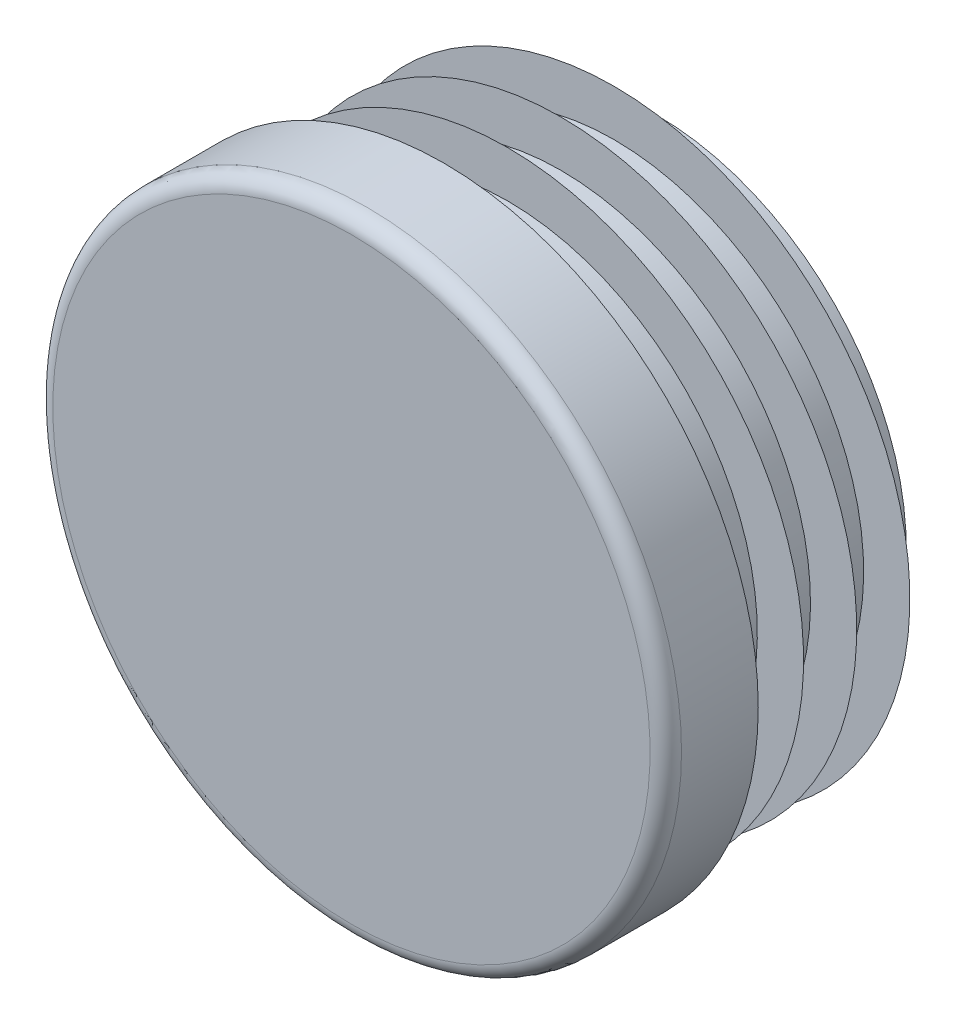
ISO-10303-21;
HEADER;
FILE_DESCRIPTION(('STEP AP214'),'2;1');
FILE_NAME('part.step','',(''),(''),'','','');
FILE_SCHEMA(('AUTOMOTIVE_DESIGN { 1 0 10303 214 1 1 1 1 }'));
ENDSEC;
DATA;
#1=APPLICATION_CONTEXT('core data for automotive mechanical design processes');
#2=APPLICATION_PROTOCOL_DEFINITION('international standard','automotive_design',2000,#1);
#3=PRODUCT_CONTEXT('',#1,'mechanical');
#4=PRODUCT('Part','Part','',(#3));
#5=PRODUCT_RELATED_PRODUCT_CATEGORY('part','',(#4));
#6=PRODUCT_DEFINITION_FORMATION('','',#4);
#7=PRODUCT_DEFINITION_CONTEXT('part definition',#1,'design');
#8=PRODUCT_DEFINITION('design','',#6,#7);
#9=PRODUCT_DEFINITION_SHAPE('','',#8);
#10=(LENGTH_UNIT() NAMED_UNIT(*) SI_UNIT(.MILLI.,.METRE.));
#11=(NAMED_UNIT(*) PLANE_ANGLE_UNIT() SI_UNIT($,.RADIAN.));
#12=(NAMED_UNIT(*) SI_UNIT($,.STERADIAN.) SOLID_ANGLE_UNIT());
#13=UNCERTAINTY_MEASURE_WITH_UNIT(LENGTH_MEASURE(1.E-05),#10,'distance_accuracy_value','');
#14=(GEOMETRIC_REPRESENTATION_CONTEXT(3) GLOBAL_UNCERTAINTY_ASSIGNED_CONTEXT((#13)) GLOBAL_UNIT_ASSIGNED_CONTEXT((#10,
#11,#12)) REPRESENTATION_CONTEXT('',''));
#15=CARTESIAN_POINT('',(0.,0.,0.));
#16=DIRECTION('',(0.,0.,1.));
#17=DIRECTION('',(1.,0.,0.));
#18=AXIS2_PLACEMENT_3D('',#15,#16,#17);
#19=CARTESIAN_POINT('',(0.,0.,5.));
#20=DIRECTION('',(0.,0.,-1.));
#21=DIRECTION('',(0.,1.,0.));
#22=AXIS2_PLACEMENT_3D('',#19,#20,#21);
#23=PLANE('',#22);
#24=CARTESIAN_POINT('',(0.,0.,5.));
#25=DIRECTION('',(0.,0.,-1.));
#26=DIRECTION('',(0.,1.,0.));
#27=AXIS2_PLACEMENT_3D('',#24,#25,#26);
#28=CIRCLE('',#27,16.15);
#29=CARTESIAN_POINT('',(0.,16.15,5.));
#30=VERTEX_POINT('',#29);
#31=EDGE_CURVE('E8',#30,#30,#28,.T.);
#32=ORIENTED_EDGE('',*,*,#31,.F.);
#33=EDGE_LOOP('',(#32));
#34=FACE_BOUND('',#33,.T.);
#35=ADVANCED_FACE('F12',(#34),#23,.F.);
#36=CARTESIAN_POINT('',(0.,0.,4.15));
#37=DIRECTION('',(0.,0.,-1.));
#38=DIRECTION('',(0.,1.,0.));
#39=AXIS2_PLACEMENT_3D('',#36,#37,#38);
#40=TOROIDAL_SURFACE('',#39,16.15,0.85);
#41=ORIENTED_EDGE('',*,*,#31,.T.);
#42=EDGE_LOOP('',(#41));
#43=FACE_BOUND('',#42,.T.);
#44=CARTESIAN_POINT('',(0.,0.,4.15));
#45=DIRECTION('',(0.,0.,-1.));
#46=DIRECTION('',(0.,1.,0.));
#47=AXIS2_PLACEMENT_3D('',#44,#45,#46);
#48=CIRCLE('',#47,17.);
#49=CARTESIAN_POINT('',(0.,17.,4.15));
#50=VERTEX_POINT('',#49);
#51=EDGE_CURVE('E18',#50,#50,#48,.T.);
#52=ORIENTED_EDGE('',*,*,#51,.F.);
#53=EDGE_LOOP('',(#52));
#54=FACE_BOUND('',#53,.T.);
#55=ADVANCED_FACE('F159',(#43,#54),#40,.T.);
#56=CARTESIAN_POINT('',(0.,0.,-11.5));
#57=DIRECTION('',(0.,0.,-1.));
#58=DIRECTION('',(0.,1.,0.));
#59=AXIS2_PLACEMENT_3D('',#56,#57,#58);
#60=CYLINDRICAL_SURFACE('',#59,17.);
#61=CARTESIAN_POINT('',(0.,0.,0.));
#62=DIRECTION('',(0.,0.,-1.));
#63=DIRECTION('',(0.,1.,0.));
#64=AXIS2_PLACEMENT_3D('',#61,#62,#63);
#65=CIRCLE('',#64,17.);
#66=CARTESIAN_POINT('',(0.,17.,0.));
#67=VERTEX_POINT('',#66);
#68=EDGE_CURVE('E22',#67,#67,#65,.T.);
#69=ORIENTED_EDGE('',*,*,#68,.F.);
#70=EDGE_LOOP('',(#69));
#71=FACE_BOUND('',#70,.T.);
#72=ORIENTED_EDGE('',*,*,#51,.T.);
#73=EDGE_LOOP('',(#72));
#74=FACE_BOUND('',#73,.T.);
#75=ADVANCED_FACE('F154',(#71,#74),#60,.T.);
#76=CARTESIAN_POINT('',(17.,0.,0.));
#77=DIRECTION('',(0.,0.,1.));
#78=DIRECTION('',(0.,-1.,0.));
#79=AXIS2_PLACEMENT_3D('',#76,#77,#78);
#80=PLANE('',#79);
#81=CARTESIAN_POINT('',(0.,0.,0.));
#82=DIRECTION('',(0.,0.,-1.));
#83=DIRECTION('',(0.,1.,0.));
#84=AXIS2_PLACEMENT_3D('',#81,#82,#83);
#85=CIRCLE('',#84,13.5);
#86=CARTESIAN_POINT('',(0.,13.5,0.));
#87=VERTEX_POINT('',#86);
#88=EDGE_CURVE('E26',#87,#87,#85,.T.);
#89=ORIENTED_EDGE('',*,*,#88,.F.);
#90=EDGE_LOOP('',(#89));
#91=FACE_BOUND('',#90,.T.);
#92=ORIENTED_EDGE('',*,*,#68,.T.);
#93=EDGE_LOOP('',(#92));
#94=FACE_BOUND('',#93,.T.);
#95=ADVANCED_FACE('F148',(#91,#94),#80,.F.);
#96=CARTESIAN_POINT('',(0.,0.,-11.5));
#97=DIRECTION('',(0.,0.,-1.));
#98=DIRECTION('',(0.,1.,0.));
#99=AXIS2_PLACEMENT_3D('',#96,#97,#98);
#100=CYLINDRICAL_SURFACE('',#99,13.5);
#101=CARTESIAN_POINT('',(0.,0.,-0.575));
#102=DIRECTION('',(0.,0.,-1.));
#103=DIRECTION('',(0.,1.,0.));
#104=AXIS2_PLACEMENT_3D('',#101,#102,#103);
#105=CIRCLE('',#104,13.5);
#106=CARTESIAN_POINT('',(0.,13.5,-0.575));
#107=VERTEX_POINT('',#106);
#108=EDGE_CURVE('E31',#107,#107,#105,.T.);
#109=ORIENTED_EDGE('',*,*,#108,.F.);
#110=EDGE_LOOP('',(#109));
#111=FACE_BOUND('',#110,.T.);
#112=ORIENTED_EDGE('',*,*,#88,.T.);
#113=EDGE_LOOP('',(#112));
#114=FACE_BOUND('',#113,.T.);
#115=ADVANCED_FACE('F142',(#111,#114),#100,.T.);
#116=CARTESIAN_POINT('',(13.5,0.,-0.575));
#117=DIRECTION('',(0.,0.,-1.));
#118=DIRECTION('',(0.,1.,0.));
#119=AXIS2_PLACEMENT_3D('',#116,#117,#118);
#120=PLANE('',#119);
#121=CARTESIAN_POINT('',(0.,0.,-0.575));
#122=DIRECTION('',(0.,0.,-1.));
#123=DIRECTION('',(0.,1.,0.));
#124=AXIS2_PLACEMENT_3D('',#121,#122,#123);
#125=CIRCLE('',#124,16.);
#126=CARTESIAN_POINT('',(0.,16.,-0.575));
#127=VERTEX_POINT('',#126);
#128=EDGE_CURVE('E34',#127,#127,#125,.T.);
#129=ORIENTED_EDGE('',*,*,#128,.F.);
#130=EDGE_LOOP('',(#129));
#131=FACE_BOUND('',#130,.T.);
#132=ORIENTED_EDGE('',*,*,#108,.T.);
#133=EDGE_LOOP('',(#132));
#134=FACE_BOUND('',#133,.T.);
#135=ADVANCED_FACE('F136',(#131,#134),#120,.F.);
#136=CARTESIAN_POINT('',(0.,0.,-0.575));
#137=DIRECTION('',(0.,0.,1.));
#138=DIRECTION('',(0.,-1.,0.));
#139=AXIS2_PLACEMENT_3D('',#136,#137,#138);
#140=CONICAL_SURFACE('',#139,16.,0.959931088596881);
#141=CARTESIAN_POINT('',(0.,0.,-2.32551884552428));
#142=DIRECTION('',(0.,0.,-1.));
#143=DIRECTION('',(0.,1.,0.));
#144=AXIS2_PLACEMENT_3D('',#141,#142,#143);
#145=CIRCLE('',#144,13.5);
#146=CARTESIAN_POINT('',(0.,13.5,-2.32551884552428));
#147=VERTEX_POINT('',#146);
#148=EDGE_CURVE('E37',#147,#147,#145,.T.);
#149=ORIENTED_EDGE('',*,*,#148,.F.);
#150=EDGE_LOOP('',(#149));
#151=FACE_BOUND('',#150,.T.);
#152=ORIENTED_EDGE('',*,*,#128,.T.);
#153=EDGE_LOOP('',(#152));
#154=FACE_BOUND('',#153,.T.);
#155=ADVANCED_FACE('F130',(#151,#154),#140,.T.);
#156=CARTESIAN_POINT('',(0.,0.,-11.5));
#157=DIRECTION('',(0.,0.,-1.));
#158=DIRECTION('',(0.,1.,0.));
#159=AXIS2_PLACEMENT_3D('',#156,#157,#158);
#160=CYLINDRICAL_SURFACE('',#159,13.5);
#161=CARTESIAN_POINT('',(0.,0.,-3.45));
#162=DIRECTION('',(0.,0.,-1.));
#163=DIRECTION('',(0.,1.,0.));
#164=AXIS2_PLACEMENT_3D('',#161,#162,#163);
#165=CIRCLE('',#164,13.5);
#166=CARTESIAN_POINT('',(0.,13.5,-3.45));
#167=VERTEX_POINT('',#166);
#168=EDGE_CURVE('E40',#167,#167,#165,.T.);
#169=ORIENTED_EDGE('',*,*,#168,.F.);
#170=EDGE_LOOP('',(#169));
#171=FACE_BOUND('',#170,.T.);
#172=ORIENTED_EDGE('',*,*,#148,.T.);
#173=EDGE_LOOP('',(#172));
#174=FACE_BOUND('',#173,.T.);
#175=ADVANCED_FACE('F124',(#171,#174),#160,.T.);
#176=CARTESIAN_POINT('',(13.5,0.,-3.45));
#177=DIRECTION('',(0.,0.,-1.));
#178=DIRECTION('',(0.,1.,0.));
#179=AXIS2_PLACEMENT_3D('',#176,#177,#178);
#180=PLANE('',#179);
#181=CARTESIAN_POINT('',(0.,0.,-3.45));
#182=DIRECTION('',(0.,0.,-1.));
#183=DIRECTION('',(0.,1.,0.));
#184=AXIS2_PLACEMENT_3D('',#181,#182,#183);
#185=CIRCLE('',#184,16.);
#186=CARTESIAN_POINT('',(0.,16.,-3.45));
#187=VERTEX_POINT('',#186);
#188=EDGE_CURVE('E43',#187,#187,#185,.T.);
#189=ORIENTED_EDGE('',*,*,#188,.F.);
#190=EDGE_LOOP('',(#189));
#191=FACE_BOUND('',#190,.T.);
#192=ORIENTED_EDGE('',*,*,#168,.T.);
#193=EDGE_LOOP('',(#192));
#194=FACE_BOUND('',#193,.T.);
#195=ADVANCED_FACE('F118',(#191,#194),#180,.F.);
#196=CARTESIAN_POINT('',(0.,0.,-3.45));
#197=DIRECTION('',(0.,0.,1.));
#198=DIRECTION('',(0.,-1.,0.));
#199=AXIS2_PLACEMENT_3D('',#196,#197,#198);
#200=CONICAL_SURFACE('',#199,16.,0.959931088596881);
#201=CARTESIAN_POINT('',(0.,0.,-5.20051884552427));
#202=DIRECTION('',(0.,0.,-1.));
#203=DIRECTION('',(0.,1.,0.));
#204=AXIS2_PLACEMENT_3D('',#201,#202,#203);
#205=CIRCLE('',#204,13.5);
#206=CARTESIAN_POINT('',(0.,13.5,-5.20051884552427));
#207=VERTEX_POINT('',#206);
#208=EDGE_CURVE('E46',#207,#207,#205,.T.);
#209=ORIENTED_EDGE('',*,*,#208,.F.);
#210=EDGE_LOOP('',(#209));
#211=FACE_BOUND('',#210,.T.);
#212=ORIENTED_EDGE('',*,*,#188,.T.);
#213=EDGE_LOOP('',(#212));
#214=FACE_BOUND('',#213,.T.);
#215=ADVANCED_FACE('F112',(#211,#214),#200,.T.);
#216=CARTESIAN_POINT('',(0.,0.,-11.5));
#217=DIRECTION('',(0.,0.,-1.));
#218=DIRECTION('',(0.,1.,0.));
#219=AXIS2_PLACEMENT_3D('',#216,#217,#218);
#220=CYLINDRICAL_SURFACE('',#219,13.5);
#221=CARTESIAN_POINT('',(0.,0.,-6.325));
#222=DIRECTION('',(0.,0.,-1.));
#223=DIRECTION('',(0.,1.,0.));
#224=AXIS2_PLACEMENT_3D('',#221,#222,#223);
#225=CIRCLE('',#224,13.5);
#226=CARTESIAN_POINT('',(0.,13.5,-6.325));
#227=VERTEX_POINT('',#226);
#228=EDGE_CURVE('E49',#227,#227,#225,.T.);
#229=ORIENTED_EDGE('',*,*,#228,.F.);
#230=EDGE_LOOP('',(#229));
#231=FACE_BOUND('',#230,.T.);
#232=ORIENTED_EDGE('',*,*,#208,.T.);
#233=EDGE_LOOP('',(#232));
#234=FACE_BOUND('',#233,.T.);
#235=ADVANCED_FACE('F106',(#231,#234),#220,.T.);
#236=CARTESIAN_POINT('',(13.5,0.,-6.325));
#237=DIRECTION('',(0.,0.,-1.));
#238=DIRECTION('',(0.,1.,0.));
#239=AXIS2_PLACEMENT_3D('',#236,#237,#238);
#240=PLANE('',#239);
#241=CARTESIAN_POINT('',(0.,0.,-6.325));
#242=DIRECTION('',(0.,0.,-1.));
#243=DIRECTION('',(0.,1.,0.));
#244=AXIS2_PLACEMENT_3D('',#241,#242,#243);
#245=CIRCLE('',#244,16.);
#246=CARTESIAN_POINT('',(0.,16.,-6.325));
#247=VERTEX_POINT('',#246);
#248=EDGE_CURVE('E52',#247,#247,#245,.T.);
#249=ORIENTED_EDGE('',*,*,#248,.F.);
#250=EDGE_LOOP('',(#249));
#251=FACE_BOUND('',#250,.T.);
#252=ORIENTED_EDGE('',*,*,#228,.T.);
#253=EDGE_LOOP('',(#252));
#254=FACE_BOUND('',#253,.T.);
#255=ADVANCED_FACE('F100',(#251,#254),#240,.F.);
#256=CARTESIAN_POINT('',(0.,0.,-6.325));
#257=DIRECTION('',(0.,0.,1.));
#258=DIRECTION('',(0.,-1.,0.));
#259=AXIS2_PLACEMENT_3D('',#256,#257,#258);
#260=CONICAL_SURFACE('',#259,16.,0.959931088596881);
#261=CARTESIAN_POINT('',(0.,0.,-8.07551884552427));
#262=DIRECTION('',(0.,0.,-1.));
#263=DIRECTION('',(0.,1.,0.));
#264=AXIS2_PLACEMENT_3D('',#261,#262,#263);
#265=CIRCLE('',#264,13.5);
#266=CARTESIAN_POINT('',(0.,13.5,-8.07551884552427));
#267=VERTEX_POINT('',#266);
#268=EDGE_CURVE('E55',#267,#267,#265,.T.);
#269=ORIENTED_EDGE('',*,*,#268,.F.);
#270=EDGE_LOOP('',(#269));
#271=FACE_BOUND('',#270,.T.);
#272=ORIENTED_EDGE('',*,*,#248,.T.);
#273=EDGE_LOOP('',(#272));
#274=FACE_BOUND('',#273,.T.);
#275=ADVANCED_FACE('F94',(#271,#274),#260,.T.);
#276=CARTESIAN_POINT('',(0.,0.,-11.5));
#277=DIRECTION('',(0.,0.,-1.));
#278=DIRECTION('',(0.,1.,0.));
#279=AXIS2_PLACEMENT_3D('',#276,#277,#278);
#280=CYLINDRICAL_SURFACE('',#279,13.5);
#281=CARTESIAN_POINT('',(0.,0.,-9.2));
#282=DIRECTION('',(0.,0.,-1.));
#283=DIRECTION('',(0.,1.,0.));
#284=AXIS2_PLACEMENT_3D('',#281,#282,#283);
#285=CIRCLE('',#284,13.5);
#286=CARTESIAN_POINT('',(0.,13.5,-9.2));
#287=VERTEX_POINT('',#286);
#288=EDGE_CURVE('E58',#287,#287,#285,.T.);
#289=ORIENTED_EDGE('',*,*,#288,.F.);
#290=EDGE_LOOP('',(#289));
#291=FACE_BOUND('',#290,.T.);
#292=ORIENTED_EDGE('',*,*,#268,.T.);
#293=EDGE_LOOP('',(#292));
#294=FACE_BOUND('',#293,.T.);
#295=ADVANCED_FACE('F88',(#291,#294),#280,.T.);
#296=CARTESIAN_POINT('',(13.5,0.,-9.2));
#297=DIRECTION('',(0.,0.,-1.));
#298=DIRECTION('',(0.,1.,0.));
#299=AXIS2_PLACEMENT_3D('',#296,#297,#298);
#300=PLANE('',#299);
#301=CARTESIAN_POINT('',(0.,0.,-9.2));
#302=DIRECTION('',(0.,0.,-1.));
#303=DIRECTION('',(0.,1.,0.));
#304=AXIS2_PLACEMENT_3D('',#301,#302,#303);
#305=CIRCLE('',#304,16.);
#306=CARTESIAN_POINT('',(0.,16.,-9.2));
#307=VERTEX_POINT('',#306);
#308=EDGE_CURVE('E61',#307,#307,#305,.T.);
#309=ORIENTED_EDGE('',*,*,#308,.F.);
#310=EDGE_LOOP('',(#309));
#311=FACE_BOUND('',#310,.T.);
#312=ORIENTED_EDGE('',*,*,#288,.T.);
#313=EDGE_LOOP('',(#312));
#314=FACE_BOUND('',#313,.T.);
#315=ADVANCED_FACE('F82',(#311,#314),#300,.F.);
#316=CARTESIAN_POINT('',(0.,0.,-9.2));
#317=DIRECTION('',(0.,0.,1.));
#318=DIRECTION('',(0.,-1.,0.));
#319=AXIS2_PLACEMENT_3D('',#316,#317,#318);
#320=CONICAL_SURFACE('',#319,16.,0.959931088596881);
#321=CARTESIAN_POINT('',(0.,0.,-10.9505188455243));
#322=DIRECTION('',(0.,0.,-1.));
#323=DIRECTION('',(0.,1.,0.));
#324=AXIS2_PLACEMENT_3D('',#321,#322,#323);
#325=CIRCLE('',#324,13.5);
#326=CARTESIAN_POINT('',(0.,13.5,-10.9505188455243));
#327=VERTEX_POINT('',#326);
#328=EDGE_CURVE('E64',#327,#327,#325,.T.);
#329=ORIENTED_EDGE('',*,*,#328,.F.);
#330=EDGE_LOOP('',(#329));
#331=FACE_BOUND('',#330,.T.);
#332=ORIENTED_EDGE('',*,*,#308,.T.);
#333=EDGE_LOOP('',(#332));
#334=FACE_BOUND('',#333,.T.);
#335=ADVANCED_FACE('F76',(#331,#334),#320,.T.);
#336=CARTESIAN_POINT('',(0.,0.,-11.5));
#337=DIRECTION('',(0.,0.,-1.));
#338=DIRECTION('',(0.,1.,0.));
#339=AXIS2_PLACEMENT_3D('',#336,#337,#338);
#340=CYLINDRICAL_SURFACE('',#339,13.5);
#341=CARTESIAN_POINT('',(0.,0.,-11.5));
#342=DIRECTION('',(0.,0.,-1.));
#343=DIRECTION('',(0.,1.,0.));
#344=AXIS2_PLACEMENT_3D('',#341,#342,#343);
#345=CIRCLE('',#344,13.5);
#346=CARTESIAN_POINT('',(0.,13.5,-11.5));
#347=VERTEX_POINT('',#346);
#348=EDGE_CURVE('E67',#347,#347,#345,.T.);
#349=ORIENTED_EDGE('',*,*,#348,.F.);
#350=EDGE_LOOP('',(#349));
#351=FACE_BOUND('',#350,.T.);
#352=ORIENTED_EDGE('',*,*,#328,.T.);
#353=EDGE_LOOP('',(#352));
#354=FACE_BOUND('',#353,.T.);
#355=ADVANCED_FACE('F73',(#351,#354),#340,.T.);
#356=CARTESIAN_POINT('',(13.5,0.,-11.5));
#357=DIRECTION('',(0.,0.,1.));
#358=DIRECTION('',(0.,-1.,0.));
#359=AXIS2_PLACEMENT_3D('',#356,#357,#358);
#360=PLANE('',#359);
#361=ORIENTED_EDGE('',*,*,#348,.T.);
#362=EDGE_LOOP('',(#361));
#363=FACE_BOUND('',#362,.T.);
#364=ADVANCED_FACE('F71',(#363),#360,.F.);
#365=CLOSED_SHELL('',(#35,#55,#75,#95,#115,#135,#155,#175,#195,#215,#235,#255,#275,#295,#315,
#335,#355,#364));
#366=MANIFOLD_SOLID_BREP('B1',#365);
#367=ADVANCED_BREP_SHAPE_REPRESENTATION('',(#18,#366),#14);
#368=SHAPE_DEFINITION_REPRESENTATION(#9,#367);
ENDSEC;
END-ISO-10303-21;
